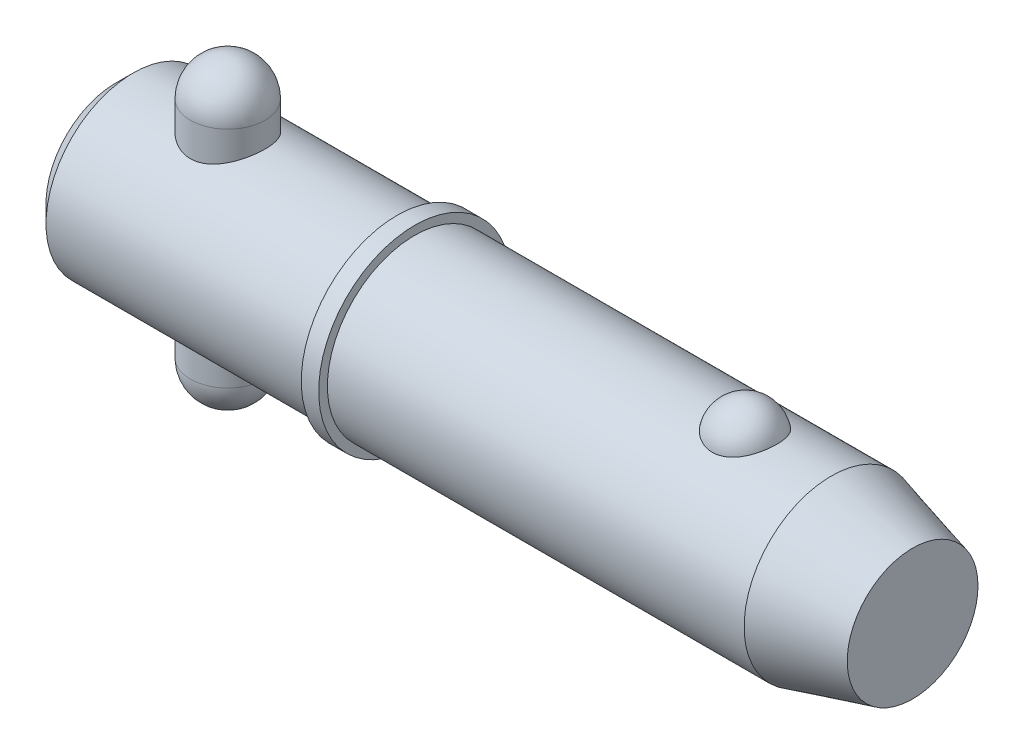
ISO-10303-21;
HEADER;
FILE_DESCRIPTION(('STEP AP214'),'2;1');
FILE_NAME('part.step','',(''),(''),'','','');
FILE_SCHEMA(('AUTOMOTIVE_DESIGN { 1 0 10303 214 1 1 1 1 }'));
ENDSEC;
DATA;
#1=APPLICATION_CONTEXT('core data for automotive mechanical design processes');
#2=APPLICATION_PROTOCOL_DEFINITION('international standard','automotive_design',2000,#1);
#3=PRODUCT_CONTEXT('',#1,'mechanical');
#4=PRODUCT('Part','Part','',(#3));
#5=PRODUCT_RELATED_PRODUCT_CATEGORY('part','',(#4));
#6=PRODUCT_DEFINITION_FORMATION('','',#4);
#7=PRODUCT_DEFINITION_CONTEXT('part definition',#1,'design');
#8=PRODUCT_DEFINITION('design','',#6,#7);
#9=PRODUCT_DEFINITION_SHAPE('','',#8);
#10=(LENGTH_UNIT() NAMED_UNIT(*) SI_UNIT(.MILLI.,.METRE.));
#11=(NAMED_UNIT(*) PLANE_ANGLE_UNIT() SI_UNIT($,.RADIAN.));
#12=(NAMED_UNIT(*) SI_UNIT($,.STERADIAN.) SOLID_ANGLE_UNIT());
#13=UNCERTAINTY_MEASURE_WITH_UNIT(LENGTH_MEASURE(1.E-05),#10,'distance_accuracy_value','');
#14=(GEOMETRIC_REPRESENTATION_CONTEXT(3) GLOBAL_UNCERTAINTY_ASSIGNED_CONTEXT((#13)) GLOBAL_UNIT_ASSIGNED_CONTEXT((#10,
#11,#12)) REPRESENTATION_CONTEXT('',''));
#15=CARTESIAN_POINT('',(0.,0.,0.));
#16=DIRECTION('',(0.,0.,1.));
#17=DIRECTION('',(1.,0.,0.));
#18=AXIS2_PLACEMENT_3D('',#15,#16,#17);
#19=CARTESIAN_POINT('',(14.28,19.05,0.));
#20=DIRECTION('',(0.,-1.,0.));
#21=DIRECTION('',(0.,0.,-1.));
#22=AXIS2_PLACEMENT_3D('',#19,#20,#21);
#23=CYLINDRICAL_SURFACE('',#22,4.76);
#24=CARTESIAN_POINT('',(14.28,-14.29,0.));
#25=DIRECTION('',(0.,-1.,0.));
#26=DIRECTION('',(0.,0.,-1.));
#27=AXIS2_PLACEMENT_3D('',#24,#25,#26);
#28=CIRCLE('',#27,4.76);
#29=CARTESIAN_POINT('',(14.28,-14.29,-4.76));
#30=VERTEX_POINT('',#29);
#31=EDGE_CURVE('P0_E10',#30,#30,#28,.F.);
#32=CARTESIAN_POINT('',(14.28,14.29,0.));
#33=DIRECTION('',(0.,-1.,0.));
#34=DIRECTION('',(0.,0.,-1.));
#35=AXIS2_PLACEMENT_3D('',#32,#33,#34);
#36=CIRCLE('',#35,4.76);
#37=CARTESIAN_POINT('',(14.28,14.29,-4.76));
#38=VERTEX_POINT('',#37);
#39=EDGE_CURVE('P0_E21',#38,#38,#36,.T.);
#40=CARTESIAN_POINT('',(14.28,-14.29,-4.76));
#41=CARTESIAN_POINT('',(14.28,-13.9922916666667,-4.76));
#42=CARTESIAN_POINT('',(14.28,-13.6945833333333,-4.76));
#43=CARTESIAN_POINT('',(14.28,-13.0991666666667,-4.76));
#44=CARTESIAN_POINT('',(14.28,-12.8014583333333,-4.76));
#45=CARTESIAN_POINT('',(14.28,-12.2060416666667,-4.76));
#46=CARTESIAN_POINT('',(14.28,-11.9083333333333,-4.76));
#47=CARTESIAN_POINT('',(14.28,-11.3129166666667,-4.76));
#48=CARTESIAN_POINT('',(14.28,-11.0152083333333,-4.76));
#49=CARTESIAN_POINT('',(14.28,-10.4197916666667,-4.76));
#50=CARTESIAN_POINT('',(14.28,-10.1220833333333,-4.76));
#51=CARTESIAN_POINT('',(14.28,-9.52666666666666,-4.76));
#52=CARTESIAN_POINT('',(14.28,-9.22895833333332,-4.76));
#53=CARTESIAN_POINT('',(14.28,-8.63354166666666,-4.76));
#54=CARTESIAN_POINT('',(14.28,-8.33583333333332,-4.76));
#55=CARTESIAN_POINT('',(14.28,-7.74041666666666,-4.76));
#56=CARTESIAN_POINT('',(14.28,-7.44270833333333,-4.76));
#57=CARTESIAN_POINT('',(14.28,-6.84729166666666,-4.76));
#58=CARTESIAN_POINT('',(14.28,-6.54958333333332,-4.76));
#59=CARTESIAN_POINT('',(14.28,-5.95416666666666,-4.76));
#60=CARTESIAN_POINT('',(14.28,-5.65645833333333,-4.76));
#61=CARTESIAN_POINT('',(14.28,-5.06104166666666,-4.76));
#62=CARTESIAN_POINT('',(14.28,-4.76333333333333,-4.76));
#63=CARTESIAN_POINT('',(14.28,-4.16791666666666,-4.76));
#64=CARTESIAN_POINT('',(14.28,-3.87020833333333,-4.76));
#65=CARTESIAN_POINT('',(14.28,-3.27479166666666,-4.76));
#66=CARTESIAN_POINT('',(14.28,-2.97708333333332,-4.76));
#67=CARTESIAN_POINT('',(14.28,-2.38166666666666,-4.76));
#68=CARTESIAN_POINT('',(14.28,-2.08395833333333,-4.76));
#69=CARTESIAN_POINT('',(14.28,-1.48854166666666,-4.76));
#70=CARTESIAN_POINT('',(14.28,-1.19083333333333,-4.76));
#71=CARTESIAN_POINT('',(14.28,-0.595416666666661,-4.76));
#72=CARTESIAN_POINT('',(14.28,-0.297708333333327,-4.76));
#73=CARTESIAN_POINT('',(14.28,0.297708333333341,-4.76));
#74=CARTESIAN_POINT('',(14.28,0.595416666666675,-4.76));
#75=CARTESIAN_POINT('',(14.28,1.19083333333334,-4.76));
#76=CARTESIAN_POINT('',(14.28,1.48854166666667,-4.76));
#77=CARTESIAN_POINT('',(14.28,2.08395833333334,-4.76));
#78=CARTESIAN_POINT('',(14.28,2.38166666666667,-4.76));
#79=CARTESIAN_POINT('',(14.28,2.97708333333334,-4.76));
#80=CARTESIAN_POINT('',(14.28,3.27479166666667,-4.76));
#81=CARTESIAN_POINT('',(14.28,3.87020833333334,-4.76));
#82=CARTESIAN_POINT('',(14.28,4.16791666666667,-4.76));
#83=CARTESIAN_POINT('',(14.28,4.76333333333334,-4.76));
#84=CARTESIAN_POINT('',(14.28,5.06104166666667,-4.76));
#85=CARTESIAN_POINT('',(14.28,5.65645833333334,-4.76));
#86=CARTESIAN_POINT('',(14.28,5.95416666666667,-4.76));
#87=CARTESIAN_POINT('',(14.28,6.54958333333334,-4.76));
#88=CARTESIAN_POINT('',(14.28,6.84729166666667,-4.76));
#89=CARTESIAN_POINT('',(14.28,7.44270833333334,-4.76));
#90=CARTESIAN_POINT('',(14.28,7.74041666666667,-4.76));
#91=CARTESIAN_POINT('',(14.28,8.33583333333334,-4.76));
#92=CARTESIAN_POINT('',(14.28,8.63354166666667,-4.76));
#93=CARTESIAN_POINT('',(14.28,9.22895833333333,-4.76));
#94=CARTESIAN_POINT('',(14.28,9.52666666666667,-4.76));
#95=CARTESIAN_POINT('',(14.28,10.1220833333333,-4.76));
#96=CARTESIAN_POINT('',(14.28,10.4197916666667,-4.76));
#97=CARTESIAN_POINT('',(14.28,11.0152083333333,-4.76));
#98=CARTESIAN_POINT('',(14.28,11.3129166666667,-4.76));
#99=CARTESIAN_POINT('',(14.28,11.9083333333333,-4.76));
#100=CARTESIAN_POINT('',(14.28,12.2060416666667,-4.76));
#101=CARTESIAN_POINT('',(14.28,12.8014583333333,-4.76));
#102=CARTESIAN_POINT('',(14.28,13.0991666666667,-4.76));
#103=CARTESIAN_POINT('',(14.28,13.6945833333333,-4.76));
#104=CARTESIAN_POINT('',(14.28,13.9922916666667,-4.76));
#105=CARTESIAN_POINT('',(14.28,14.29,-4.76));
#106=B_SPLINE_CURVE_WITH_KNOTS('',3,(#40,#41,#42,#43,#44,#45,#46,#47,#48,#49,#50,#51,#52,#53,
#54,#55,#56,#57,#58,#59,#60,#61,#62,#63,#64,#65,#66,#67,#68,#69,#70,#71,#72,#73,#74,#75,#76,#77,
#78,#79,#80,#81,#82,#83,#84,#85,#86,#87,#88,#89,#90,#91,#92,#93,#94,#95,#96,#97,#98,#99,#100,
#101,#102,#103,#104,#105),.UNSPECIFIED.,.F.,.F.,(4,2,2,2,2,2,2,2,2,2,2,2,2,2,2,2,2,2,2,2,2,2,2,
2,2,2,2,2,2,2,2,2,4),(0.,0.893125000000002,1.78625,2.67937499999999,3.5725,4.465625,5.35875,
6.25187499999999,7.145,8.038125,8.93125,9.82437499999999,10.7175,11.610625,12.50375,13.396875,
14.29,15.183125,16.07625,16.969375,17.8625,18.755625,19.64875,20.541875,21.435,22.328125,
23.22125,24.114375,25.0075,25.900625,26.79375,27.686875,28.58),.UNSPECIFIED.);
#107=EDGE_CURVE('P0_BSEAM14',#30,#38,#106,.T.);
#108=ORIENTED_EDGE('',*,*,#31,.T.);
#109=ORIENTED_EDGE('',*,*,#39,.T.);
#110=ORIENTED_EDGE('',*,*,#107,.T.);
#111=ORIENTED_EDGE('',*,*,#107,.F.);
#112=EDGE_LOOP('',(#108,#110,#109,#111));
#113=FACE_BOUND('',#112,.T.);
#114=ADVANCED_FACE('P0_F14',(#113),#23,.T.);
#115=CARTESIAN_POINT('',(14.28,-14.29,0.));
#116=DIRECTION('',(0.,0.,1.));
#117=DIRECTION('',(1.,0.,0.));
#118=AXIS2_PLACEMENT_3D('',#115,#116,#117);
#119=SPHERICAL_SURFACE('',#118,4.76);
#120=CARTESIAN_POINT('',(14.28,-14.29,0.));
#121=DIRECTION('',(0.,-1.,0.));
#122=DIRECTION('',(0.,0.,-1.));
#123=AXIS2_PLACEMENT_3D('',#120,#121,#122);
#124=SPHERICAL_SURFACE('',#123,4.76);
#125=ORIENTED_EDGE('',*,*,#31,.F.);
#126=EDGE_LOOP('',(#125));
#127=FACE_BOUND('',#126,.T.);
#128=ADVANCED_FACE('P0_F29',(#127),#124,.T.);
#129=CARTESIAN_POINT('',(14.28,14.29,0.));
#130=DIRECTION('',(0.,0.,1.));
#131=DIRECTION('',(1.,0.,0.));
#132=AXIS2_PLACEMENT_3D('',#129,#130,#131);
#133=SPHERICAL_SURFACE('',#132,4.76);
#134=CARTESIAN_POINT('',(14.28,14.29,0.));
#135=DIRECTION('',(0.,-1.,0.));
#136=DIRECTION('',(0.,0.,-1.));
#137=AXIS2_PLACEMENT_3D('',#134,#135,#136);
#138=SPHERICAL_SURFACE('',#137,4.76);
#139=ORIENTED_EDGE('',*,*,#39,.F.);
#140=EDGE_LOOP('',(#139));
#141=FACE_BOUND('',#140,.T.);
#142=ADVANCED_FACE('P0_F16',(#141),#138,.T.);
#143=CLOSED_SHELL('',(#114,#128,#142));
#144=MANIFOLD_SOLID_BREP('P0_B1',#143);
#145=CARTESIAN_POINT('',(0.,0.,0.));
#146=DIRECTION('',(1.,0.,0.));
#147=DIRECTION('',(0.,0.,-1.));
#148=AXIS2_PLACEMENT_3D('',#145,#146,#147);
#149=CYLINDRICAL_SURFACE('',#148,11.115);
#150=CARTESIAN_POINT('',(91.229563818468,0.,0.));
#151=DIRECTION('',(1.,0.,0.));
#152=DIRECTION('',(0.,0.,-1.));
#153=AXIS2_PLACEMENT_3D('',#150,#151,#152);
#154=CIRCLE('',#153,11.115);
#155=CARTESIAN_POINT('',(91.229563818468,0.,-11.115));
#156=VERTEX_POINT('',#155);
#157=EDGE_CURVE('P1_E81',#156,#156,#154,.T.);
#158=ORIENTED_EDGE('',*,*,#157,.F.);
#159=EDGE_LOOP('',(#158));
#160=FACE_BOUND('',#159,.T.);
#161=CARTESIAN_POINT('',(38.1,0.,0.));
#162=DIRECTION('',(1.,0.,0.));
#163=DIRECTION('',(0.,0.,-1.));
#164=AXIS2_PLACEMENT_3D('',#161,#162,#163);
#165=CIRCLE('',#164,11.115);
#166=CARTESIAN_POINT('',(38.1,0.,-11.115));
#167=VERTEX_POINT('',#166);
#168=EDGE_CURVE('P1_E85',#167,#167,#165,.T.);
#169=ORIENTED_EDGE('',*,*,#168,.T.);
#170=EDGE_LOOP('',(#169));
#171=FACE_BOUND('',#170,.T.);
#172=CARTESIAN_POINT('',(80.2310680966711,10.3028087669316,4.17077409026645));
#173=CARTESIAN_POINT('',(80.0147756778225,10.3028003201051,4.17078240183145));
#174=CARTESIAN_POINT('',(79.7985488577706,10.3098895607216,4.15340593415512));
#175=CARTESIAN_POINT('',(79.3725408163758,10.3373834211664,4.08449540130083));
#176=CARTESIAN_POINT('',(79.1627577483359,10.3577841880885,4.03297121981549));
#177=CARTESIAN_POINT('',(78.7557825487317,10.4095237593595,3.89746513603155));
#178=CARTESIAN_POINT('',(78.5585726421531,10.4408466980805,3.81353029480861));
#179=CARTESIAN_POINT('',(78.1813382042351,10.5110236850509,3.61560339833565));
#180=CARTESIAN_POINT('',(78.0013171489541,10.5498792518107,3.50160528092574));
#181=CARTESIAN_POINT('',(77.6576842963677,10.6322884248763,3.24292464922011));
#182=CARTESIAN_POINT('',(77.4946861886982,10.6759443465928,3.09746040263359));
#183=CARTESIAN_POINT('',(77.1945911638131,10.7625291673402,2.78171925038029));
#184=CARTESIAN_POINT('',(77.0574990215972,10.8054579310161,2.61143778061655));
#185=CARTESIAN_POINT('',(76.8064084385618,10.8881935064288,2.24226695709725));
#186=CARTESIAN_POINT('',(76.6937105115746,10.9277761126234,2.04244123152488));
#187=CARTESIAN_POINT('',(76.5017771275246,10.997484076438,1.62578254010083));
#188=CARTESIAN_POINT('',(76.422544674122,11.0276085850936,1.40894804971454));
#189=CARTESIAN_POINT('',(76.2983034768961,11.0756732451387,0.961250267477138));
#190=CARTESIAN_POINT('',(76.253760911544,11.0934470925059,0.730239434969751));
#191=CARTESIAN_POINT('',(76.2015695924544,11.1143331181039,0.263439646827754));
#192=CARTESIAN_POINT('',(76.1939200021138,11.1174456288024,0.0276507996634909));
#193=CARTESIAN_POINT('',(76.2156105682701,11.1087161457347,-0.440729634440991));
#194=CARTESIAN_POINT('',(76.2447624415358,11.0969502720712,-0.673331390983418));
#195=CARTESIAN_POINT('',(76.3391432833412,11.0597872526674,-1.12996621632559));
#196=CARTESIAN_POINT('',(76.4043729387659,11.0343898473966,-1.35399912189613));
#197=CARTESIAN_POINT('',(76.5696984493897,10.972515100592,-1.78750286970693));
#198=CARTESIAN_POINT('',(76.6698386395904,10.9360236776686,-1.99695478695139));
#199=CARTESIAN_POINT('',(76.9029408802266,10.8557595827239,-2.3952066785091));
#200=CARTESIAN_POINT('',(77.0359054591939,10.8119863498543,-2.5840050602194));
#201=CARTESIAN_POINT('',(77.332407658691,10.7216733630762,-2.93635726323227));
#202=CARTESIAN_POINT('',(77.4960565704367,10.675123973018,-3.09981510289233));
#203=CARTESIAN_POINT('',(77.8498601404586,10.5846571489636,-3.39592247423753));
#204=CARTESIAN_POINT('',(78.0400123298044,10.5407394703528,-3.52857487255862));
#205=CARTESIAN_POINT('',(78.4375014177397,10.4616690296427,-3.75646057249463));
#206=CARTESIAN_POINT('',(78.6443670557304,10.4263443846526,-3.85245432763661));
#207=CARTESIAN_POINT('',(79.0729541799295,10.3675574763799,-4.00798747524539));
#208=CARTESIAN_POINT('',(79.294670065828,10.3440907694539,-4.06754052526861));
#209=CARTESIAN_POINT('',(79.7346695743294,10.3128282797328,-4.14614314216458));
#210=CARTESIAN_POINT('',(79.9525654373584,10.3043040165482,-4.1670783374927));
#211=CARTESIAN_POINT('',(80.3889495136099,10.3016771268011,-4.17357158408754));
#212=CARTESIAN_POINT('',(80.6074376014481,10.3075716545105,-4.15913661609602));
#213=CARTESIAN_POINT('',(81.0317442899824,10.3326686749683,-4.09636961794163));
#214=CARTESIAN_POINT('',(81.2377458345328,10.3514555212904,-4.0490957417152));
#215=CARTESIAN_POINT('',(81.6385764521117,10.399818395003,-3.92320197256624));
#216=CARTESIAN_POINT('',(81.8334046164,10.4293952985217,-3.84457953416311));
#217=CARTESIAN_POINT('',(82.2111917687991,10.4969600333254,-3.65612410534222));
#218=CARTESIAN_POINT('',(82.3937974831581,10.5351178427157,-3.54564545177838));
#219=CARTESIAN_POINT('',(82.7382040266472,10.6154999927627,-3.29718036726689));
#220=CARTESIAN_POINT('',(82.900000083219,10.657725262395,-3.15918764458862));
#221=CARTESIAN_POINT('',(83.2069596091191,10.744212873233,-2.85163580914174));
#222=CARTESIAN_POINT('',(83.3508919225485,10.7884718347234,-2.68084605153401));
#223=CARTESIAN_POINT('',(83.6092371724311,10.872374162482,-2.31721864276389));
#224=CARTESIAN_POINT('',(83.7236448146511,10.9120167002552,-2.12437704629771));
#225=CARTESIAN_POINT('',(83.9238739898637,10.9838919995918,-1.71516999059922));
#226=CARTESIAN_POINT('',(84.0086617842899,11.0158465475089,-1.498248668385));
#227=CARTESIAN_POINT('',(84.1426838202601,11.0673523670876,-1.052285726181));
#228=CARTESIAN_POINT('',(84.1919174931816,11.086903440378,-0.823243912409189));
#229=CARTESIAN_POINT('',(84.2538915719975,11.1116323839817,-0.359087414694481));
#230=CARTESIAN_POINT('',(84.2665662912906,11.1167843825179,-0.123962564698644));
#231=CARTESIAN_POINT('',(84.254973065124,11.1121144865,0.345220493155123));
#232=CARTESIAN_POINT('',(84.2307056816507,11.1022928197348,0.579278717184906));
#233=CARTESIAN_POINT('',(84.1459073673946,11.0687504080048,1.03866534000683));
#234=CARTESIAN_POINT('',(84.0855299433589,11.0450885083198,1.26402641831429));
#235=CARTESIAN_POINT('',(83.9298532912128,10.9863185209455,1.70076772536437));
#236=CARTESIAN_POINT('',(83.834551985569,10.9512097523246,1.91214712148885));
#237=CARTESIAN_POINT('',(83.6103974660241,10.8729733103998,2.31608359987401));
#238=CARTESIAN_POINT('',(83.4813806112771,10.8298068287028,2.50854240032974));
#239=CARTESIAN_POINT('',(83.1927327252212,10.7401896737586,2.86808766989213));
#240=CARTESIAN_POINT('',(83.0331022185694,10.6937390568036,3.03517457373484));
#241=CARTESIAN_POINT('',(82.6875341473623,10.6029321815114,3.33857581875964));
#242=CARTESIAN_POINT('',(82.5017089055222,10.5585680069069,3.47501541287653));
#243=CARTESIAN_POINT('',(82.1078750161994,10.4769321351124,3.71390897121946));
#244=CARTESIAN_POINT('',(81.8998635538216,10.439661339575,3.81635861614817));
#245=CARTESIAN_POINT('',(81.4540666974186,10.3749407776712,3.98910631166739));
#246=CARTESIAN_POINT('',(81.2152342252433,10.3482457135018,4.05700929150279));
#247=CARTESIAN_POINT('',(80.7279254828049,10.312188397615,4.14782844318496));
#248=CARTESIAN_POINT('',(80.4794535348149,10.3028184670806,4.17076454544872));
#249=CARTESIAN_POINT('',(80.2310680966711,10.3028087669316,4.17077409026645));
#250=B_SPLINE_CURVE_WITH_KNOTS('',3,(#172,#173,#174,#175,#176,#177,#178,#179,#180,#181,#182,
#183,#184,#185,#186,#187,#188,#189,#190,#191,#192,#193,#194,#195,#196,#197,#198,#199,#200,#201,
#202,#203,#204,#205,#206,#207,#208,#209,#210,#211,#212,#213,#214,#215,#216,#217,#218,#219,#220,
#221,#222,#223,#224,#225,#226,#227,#228,#229,#230,#231,#232,#233,#234,#235,#236,#237,#238,#239,
#240,#241,#242,#243,#244,#245,#246,#247,#248,#249),.UNSPECIFIED.,.T.,.F.,(4,2,2,2,2,2,2,2,2,2,2,
2,2,2,2,2,2,2,2,2,2,2,2,2,2,2,2,2,2,2,2,2,2,2,2,2,2,2,4),(0.,0.647966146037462,1.29574482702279,
1.94258643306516,2.58955857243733,3.25496465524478,3.92049326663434,4.61566368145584,
5.31089647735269,6.01531821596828,6.71972398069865,7.42054043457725,8.12137023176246,
8.82309331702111,9.52487047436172,10.2292439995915,10.9335519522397,11.6223330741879,
12.3108558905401,12.9647664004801,13.6185478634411,14.2521847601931,14.8858731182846,
15.5334360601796,16.1811472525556,16.8611459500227,17.5412664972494,18.2431855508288,
18.9451158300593,19.6483065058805,20.3514864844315,21.0516982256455,21.7519516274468,
22.4556690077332,23.1593743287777,23.8601491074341,24.5610129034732,25.3054529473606,
26.049562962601),.UNSPECIFIED.);
#251=CARTESIAN_POINT('',(80.2310680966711,10.3028087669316,4.17077409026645));
#252=VERTEX_POINT('',#251);
#253=EDGE_CURVE('P1_E35',#252,#252,#250,.T.);
#254=ORIENTED_EDGE('',*,*,#253,.T.);
#255=EDGE_LOOP('',(#254));
#256=FACE_BOUND('',#255,.T.);
#257=ADVANCED_FACE('P1_F13',(#160,#171,#256),#149,.T.);
#258=CARTESIAN_POINT('',(0.,0.,0.));
#259=DIRECTION('',(-1.,0.,0.));
#260=DIRECTION('',(0.,0.,1.));
#261=AXIS2_PLACEMENT_3D('',#258,#259,#260);
#262=PLANE('',#261);
#263=CARTESIAN_POINT('',(0.,0.,0.));
#264=DIRECTION('',(1.,0.,0.));
#265=DIRECTION('',(0.,0.,-1.));
#266=AXIS2_PLACEMENT_3D('',#263,#264,#265);
#267=CIRCLE('',#266,8.892);
#268=CARTESIAN_POINT('',(0.,0.,-8.892));
#269=VERTEX_POINT('',#268);
#270=EDGE_CURVE('P1_E9',#269,#269,#267,.T.);
#271=ORIENTED_EDGE('',*,*,#270,.F.);
#272=EDGE_LOOP('',(#271));
#273=FACE_BOUND('',#272,.T.);
#274=ADVANCED_FACE('P1_F15',(#273),#262,.T.);
#275=CARTESIAN_POINT('',(2.22299999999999,0.,0.));
#276=DIRECTION('',(1.,0.,0.));
#277=DIRECTION('',(0.,0.,-1.));
#278=AXIS2_PLACEMENT_3D('',#275,#276,#277);
#279=CONICAL_SURFACE('',#278,11.115,0.78539816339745);
#280=ORIENTED_EDGE('',*,*,#270,.T.);
#281=EDGE_LOOP('',(#280));
#282=FACE_BOUND('',#281,.T.);
#283=CARTESIAN_POINT('',(2.22299999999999,0.,0.));
#284=DIRECTION('',(1.,0.,0.));
#285=DIRECTION('',(0.,0.,-1.));
#286=AXIS2_PLACEMENT_3D('',#283,#284,#285);
#287=CIRCLE('',#286,11.115);
#288=CARTESIAN_POINT('',(2.22299999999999,0.,-11.115));
#289=VERTEX_POINT('',#288);
#290=EDGE_CURVE('P1_E26',#289,#289,#287,.T.);
#291=ORIENTED_EDGE('',*,*,#290,.F.);
#292=EDGE_LOOP('',(#291));
#293=FACE_BOUND('',#292,.T.);
#294=ADVANCED_FACE('P1_F77',(#282,#293),#279,.T.);
#295=CARTESIAN_POINT('',(0.,0.,0.));
#296=DIRECTION('',(1.,0.,0.));
#297=DIRECTION('',(0.,0.,-1.));
#298=AXIS2_PLACEMENT_3D('',#295,#296,#297);
#299=CYLINDRICAL_SURFACE('',#298,11.115);
#300=CARTESIAN_POINT('',(14.28,-10.0441836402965,4.76));
#301=CARTESIAN_POINT('',(14.1533731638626,-10.0441846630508,4.75999904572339));
#302=CARTESIAN_POINT('',(14.0267055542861,-10.0465865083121,4.75493985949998));
#303=CARTESIAN_POINT('',(13.774298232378,-10.0561141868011,4.73475585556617));
#304=CARTESIAN_POINT('',(13.6485591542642,-10.0632429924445,4.71962470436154));
#305=CARTESIAN_POINT('',(13.3987500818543,-10.0819979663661,4.67942666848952));
#306=CARTESIAN_POINT('',(13.2746840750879,-10.0936334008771,4.65433930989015));
#307=CARTESIAN_POINT('',(13.0293244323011,-10.1210146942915,4.59449317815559));
#308=CARTESIAN_POINT('',(12.9080319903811,-10.1367622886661,4.55973032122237));
#309=CARTESIAN_POINT('',(12.669614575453,-10.1717810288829,4.48106435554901));
#310=CARTESIAN_POINT('',(12.5524727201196,-10.1910352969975,4.4372048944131));
#311=CARTESIAN_POINT('',(12.3224300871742,-10.2325403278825,4.34063417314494));
#312=CARTESIAN_POINT('',(12.2095309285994,-10.2547922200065,4.28791957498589));
#313=CARTESIAN_POINT('',(11.8782785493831,-10.3250879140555,4.11715127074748));
#314=CARTESIAN_POINT('',(11.6670799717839,-10.3767168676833,3.98637638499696));
#315=CARTESIAN_POINT('',(11.2564039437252,-10.4874309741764,3.68567149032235));
#316=CARTESIAN_POINT('',(11.0583793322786,-10.5467772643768,3.51386978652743));
#317=CARTESIAN_POINT('',(10.6927724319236,-10.6641377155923,3.13969960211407));
#318=CARTESIAN_POINT('',(10.5252022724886,-10.7221513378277,2.93731900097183));
#319=CARTESIAN_POINT('',(10.2965609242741,-10.8050020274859,2.60935726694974));
#320=CARTESIAN_POINT('',(10.2227768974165,-10.8324811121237,2.49310321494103));
#321=CARTESIAN_POINT('',(10.0853380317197,-10.884703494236,2.25418999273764));
#322=CARTESIAN_POINT('',(10.0216789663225,-10.9094479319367,2.13153352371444));
#323=CARTESIAN_POINT('',(9.90506238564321,-10.9554932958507,1.88060370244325));
#324=CARTESIAN_POINT('',(9.85210574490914,-10.9767939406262,1.7523298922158));
#325=CARTESIAN_POINT('',(9.75746464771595,-11.0153112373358,1.49115740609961));
#326=CARTESIAN_POINT('',(9.71577447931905,-11.0325299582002,1.35826111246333));
#327=CARTESIAN_POINT('',(9.64605475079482,-11.0615607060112,1.09614539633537));
#328=CARTESIAN_POINT('',(9.61740732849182,-11.0736151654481,0.96711700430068));
#329=CARTESIAN_POINT('',(9.57092026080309,-11.0932687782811,0.706847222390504));
#330=CARTESIAN_POINT('',(9.55307574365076,-11.1008699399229,0.575606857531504));
#331=CARTESIAN_POINT('',(9.52838640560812,-11.1114054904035,0.31192917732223));
#332=CARTESIAN_POINT('',(9.52153986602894,-11.114340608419,0.179492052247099));
#333=CARTESIAN_POINT('',(9.51892405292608,-11.1154607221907,-0.0855090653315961));
#334=CARTESIAN_POINT('',(9.52315432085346,-11.1136459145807,-0.218073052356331));
#335=CARTESIAN_POINT('',(9.542009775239,-11.1055891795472,-0.473709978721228));
#336=CARTESIAN_POINT('',(9.55594693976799,-11.099640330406,-0.596843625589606));
#337=CARTESIAN_POINT('',(9.59332832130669,-11.0837823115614,-0.841440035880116));
#338=CARTESIAN_POINT('',(9.61677567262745,-11.0738718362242,-0.962902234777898));
#339=CARTESIAN_POINT('',(9.67294089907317,-11.0503378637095,-1.20325684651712));
#340=CARTESIAN_POINT('',(9.70565569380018,-11.0367156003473,-1.32215009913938));
#341=CARTESIAN_POINT('',(9.78005008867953,-11.0060908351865,-1.55666640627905));
#342=CARTESIAN_POINT('',(9.82173311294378,-10.9890870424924,-1.67228819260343));
#343=CARTESIAN_POINT('',(9.96110379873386,-10.9330280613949,-2.01656166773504));
#344=CARTESIAN_POINT('',(10.0722987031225,-10.8892801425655,-2.23915547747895));
#345=CARTESIAN_POINT('',(10.3268588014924,-10.7934745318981,-2.66299199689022));
#346=CARTESIAN_POINT('',(10.4702355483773,-10.7414138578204,-2.86422700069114));
#347=CARTESIAN_POINT('',(10.7973904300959,-10.6296201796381,-3.25557775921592));
#348=CARTESIAN_POINT('',(10.9833705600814,-10.569604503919,-3.443774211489));
#349=CARTESIAN_POINT('',(11.3844486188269,-10.4514707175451,-3.78722133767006));
#350=CARTESIAN_POINT('',(11.5995590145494,-10.3933534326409,-3.94245783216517));
#351=CARTESIAN_POINT('',(11.9444340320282,-10.311516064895,-4.14990014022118));
#352=CARTESIAN_POINT('',(12.0654579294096,-10.2847012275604,-4.21573894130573));
#353=CARTESIAN_POINT('',(12.3132718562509,-10.2342051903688,-4.33688518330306));
#354=CARTESIAN_POINT('',(12.4400593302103,-10.2105226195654,-4.39219723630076));
#355=CARTESIAN_POINT('',(12.6985418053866,-10.1671237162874,-4.49174500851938));
#356=CARTESIAN_POINT('',(12.8302359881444,-10.1474067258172,-4.53598256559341));
#357=CARTESIAN_POINT('',(13.0975061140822,-10.1126841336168,-4.61287629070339));
#358=CARTESIAN_POINT('',(13.233079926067,-10.0976759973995,-4.64553869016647));
#359=CARTESIAN_POINT('',(13.4978553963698,-10.0737863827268,-4.6971059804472));
#360=CARTESIAN_POINT('',(13.6268754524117,-10.0645618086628,-4.716785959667));
#361=CARTESIAN_POINT('',(13.8862990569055,-10.051062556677,-4.74548419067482));
#362=CARTESIAN_POINT('',(14.0167019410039,-10.0467856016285,-4.75450734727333));
#363=CARTESIAN_POINT('',(14.277859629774,-10.0433352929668,-4.76179143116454));
#364=CARTESIAN_POINT('',(14.4086143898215,-10.0441613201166,-4.76005366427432));
#365=CARTESIAN_POINT('',(14.6694025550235,-10.0508838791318,-4.74584231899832));
#366=CARTESIAN_POINT('',(14.7994359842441,-10.0567802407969,-4.73336910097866));
#367=CARTESIAN_POINT('',(15.0487369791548,-10.0728449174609,-4.69907984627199));
#368=CARTESIAN_POINT('',(15.1681238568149,-10.0826872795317,-4.67797462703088));
#369=CARTESIAN_POINT('',(15.4045894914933,-10.1062580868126,-4.62682977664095));
#370=CARTESIAN_POINT('',(15.5216674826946,-10.1199877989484,-4.59678723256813));
#371=CARTESIAN_POINT('',(15.868278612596,-10.1664161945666,-4.49365911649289));
#372=CARTESIAN_POINT('',(16.0933756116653,-10.2043671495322,-4.40754694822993));
#373=CARTESIAN_POINT('',(16.5357981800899,-10.2919879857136,-4.19898201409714));
#374=CARTESIAN_POINT('',(16.7523611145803,-10.3420954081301,-4.07511281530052));
#375=CARTESIAN_POINT('',(17.1627188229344,-10.4477911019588,-3.7959429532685));
#376=CARTESIAN_POINT('',(17.3565033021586,-10.5033818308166,-3.64062816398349));
#377=CARTESIAN_POINT('',(17.7334034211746,-10.6196376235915,-3.28693729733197));
#378=CARTESIAN_POINT('',(17.9141276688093,-10.6803237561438,-3.08599175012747));
#379=CARTESIAN_POINT('',(18.1582189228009,-10.7666348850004,-2.76320365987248));
#380=CARTESIAN_POINT('',(18.2351223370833,-10.7946346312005,-2.65197124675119));
#381=CARTESIAN_POINT('',(18.3793967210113,-10.8483267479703,-2.42297927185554));
#382=CARTESIAN_POINT('',(18.4467718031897,-10.87402011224,-2.30522255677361));
#383=CARTESIAN_POINT('',(18.5717669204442,-10.9225249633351,-2.06324665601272));
#384=CARTESIAN_POINT('',(18.6293326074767,-10.9453202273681,-1.93899615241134));
#385=CARTESIAN_POINT('',(18.73370006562,-10.9872100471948,-1.6855059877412));
#386=CARTESIAN_POINT('',(18.7805065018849,-11.0063062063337,-1.55626851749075));
#387=CARTESIAN_POINT('',(18.8628731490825,-11.0402419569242,-1.29375150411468));
#388=CARTESIAN_POINT('',(18.8984366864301,-11.0550828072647,-1.16047316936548));
#389=CARTESIAN_POINT('',(18.9579183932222,-11.0800638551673,-0.890912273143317));
#390=CARTESIAN_POINT('',(18.9818374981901,-11.0902044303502,-0.75462995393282));
#391=CARTESIAN_POINT('',(19.0164177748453,-11.104911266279,-0.490295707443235));
#392=CARTESIAN_POINT('',(19.027922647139,-11.1098318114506,-0.362373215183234));
#393=CARTESIAN_POINT('',(19.040554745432,-11.1152360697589,-0.105876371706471));
#394=CARTESIAN_POINT('',(19.0416784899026,-11.1157182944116,0.0226981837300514));
#395=CARTESIAN_POINT('',(19.0335275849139,-11.1122291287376,0.27938352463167));
#396=CARTESIAN_POINT('',(19.0242587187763,-11.1082602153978,0.407494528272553));
#397=CARTESIAN_POINT('',(18.9954320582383,-11.0959792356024,0.662388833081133));
#398=CARTESIAN_POINT('',(18.9758704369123,-11.0876655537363,0.789171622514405));
#399=CARTESIAN_POINT('',(18.9276379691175,-11.0673259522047,1.03545890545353));
#400=CARTESIAN_POINT('',(18.8993573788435,-11.0554596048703,1.15505309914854));
#401=CARTESIAN_POINT('',(18.8337694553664,-11.0282166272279,1.39134516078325));
#402=CARTESIAN_POINT('',(18.7964589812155,-11.0128387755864,1.5080420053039));
#403=CARTESIAN_POINT('',(18.671464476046,-10.9619666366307,1.85262797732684));
#404=CARTESIAN_POINT('',(18.5706772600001,-10.9217161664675,2.07521484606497));
#405=CARTESIAN_POINT('',(18.33202463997,-10.8301378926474,2.51061719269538));
#406=CARTESIAN_POINT('',(18.1926775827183,-10.7783885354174,2.72252375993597));
#407=CARTESIAN_POINT('',(17.8829747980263,-10.669863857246,3.12088015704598));
#408=CARTESIAN_POINT('',(17.7126068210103,-10.6130865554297,3.30731987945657));
#409=CARTESIAN_POINT('',(17.3310036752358,-10.495668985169,3.66358491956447));
#410=CARTESIAN_POINT('',(17.1177010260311,-10.4350471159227,3.83122543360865));
#411=CARTESIAN_POINT('',(16.7778915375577,-10.3495418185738,4.05420569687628));
#412=CARTESIAN_POINT('',(16.6612023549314,-10.3219229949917,4.12383380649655));
#413=CARTESIAN_POINT('',(16.4218466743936,-10.2693487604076,4.25306463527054));
#414=CARTESIAN_POINT('',(16.2991829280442,-10.2443921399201,4.31267191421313));
#415=CARTESIAN_POINT('',(16.0488008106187,-10.1979981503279,4.42126071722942));
#416=CARTESIAN_POINT('',(15.9210894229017,-10.1765561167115,4.47025635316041));
#417=CARTESIAN_POINT('',(15.6613937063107,-10.1379191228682,4.55720152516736));
#418=CARTESIAN_POINT('',(15.5294115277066,-10.1207220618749,4.59515652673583));
#419=CARTESIAN_POINT('',(15.2624981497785,-10.091252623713,4.65951684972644));
#420=CARTESIAN_POINT('',(15.1275757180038,-10.0789672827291,4.68595259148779));
#421=CARTESIAN_POINT('',(14.8556442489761,-10.0597530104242,4.72706206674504));
#422=CARTESIAN_POINT('',(14.7186368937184,-10.0528199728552,4.74174481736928));
#423=CARTESIAN_POINT('',(14.5310955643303,-10.047196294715,4.75363843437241));
#424=CARTESIAN_POINT('',(14.48091543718,-10.0460674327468,4.75602323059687));
#425=CARTESIAN_POINT('',(14.3804923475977,-10.044560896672,4.7592042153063));
#426=CARTESIAN_POINT('',(14.3302493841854,-10.0441832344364,4.76000037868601));
#427=CARTESIAN_POINT('',(14.28,-10.0441836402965,4.76));
#428=B_SPLINE_CURVE_WITH_KNOTS('',3,(#300,#301,#302,#303,#304,#305,#306,#307,#308,#309,#310,
#311,#312,#313,#314,#315,#316,#317,#318,#319,#320,#321,#322,#323,#324,#325,#326,#327,#328,#329,
#330,#331,#332,#333,#334,#335,#336,#337,#338,#339,#340,#341,#342,#343,#344,#345,#346,#347,#348,
#349,#350,#351,#352,#353,#354,#355,#356,#357,#358,#359,#360,#361,#362,#363,#364,#365,#366,#367,
#368,#369,#370,#371,#372,#373,#374,#375,#376,#377,#378,#379,#380,#381,#382,#383,#384,#385,#386,
#387,#388,#389,#390,#391,#392,#393,#394,#395,#396,#397,#398,#399,#400,#401,#402,#403,#404,#405,
#406,#407,#408,#409,#410,#411,#412,#413,#414,#415,#416,#417,#418,#419,#420,#421,#422,#423,#424,
#425,#426,#427),.UNSPECIFIED.,.T.,.F.,(4,2,2,2,2,2,2,2,2,2,2,2,2,2,2,2,2,2,2,2,2,2,2,2,2,2,2,2,
2,2,2,2,2,2,2,2,2,2,2,2,2,2,2,2,2,2,2,2,2,2,2,2,2,2,2,2,2,2,2,2,2,2,2,4),(0.,0.379828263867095,
0.759895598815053,1.14074858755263,1.52176256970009,1.90098898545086,2.28035867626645,
3.03818035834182,3.84125131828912,4.6446414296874,5.06541657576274,5.48601561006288,
5.90664899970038,6.3270687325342,6.72470503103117,7.12216187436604,7.51955659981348,
7.91693487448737,8.28868404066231,8.66055582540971,9.03230414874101,9.40419465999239,
10.1585834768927,10.9132435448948,11.7236471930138,12.5343987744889,12.9550196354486,
13.3754557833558,13.7958221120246,14.2159617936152,14.6079540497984,14.9997658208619,
15.3915300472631,15.7832811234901,16.1477615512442,16.512360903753,17.240999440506,
18.0012974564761,18.761937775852,19.5886929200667,20.0025782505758,20.4162843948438,
20.832212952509,21.2479608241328,21.6635855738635,22.0791769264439,22.4642880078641,
22.8495282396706,23.2345541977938,23.6197234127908,23.9896813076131,24.3597680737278,
25.099327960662,25.8726239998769,26.6462260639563,27.4759193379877,27.8914891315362,
28.3068693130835,28.7216936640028,29.1363123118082,29.5498292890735,29.9630287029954,
30.113753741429,30.2644811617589),.UNSPECIFIED.);
#429=CARTESIAN_POINT('',(14.28,-10.0441836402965,4.76));
#430=VERTEX_POINT('',#429);
#431=EDGE_CURVE('P1_E17',#430,#430,#428,.T.);
#432=ORIENTED_EDGE('',*,*,#431,.F.);
#433=EDGE_LOOP('',(#432));
#434=FACE_BOUND('',#433,.T.);
#435=CARTESIAN_POINT('',(14.28,10.0441836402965,4.76));
#436=CARTESIAN_POINT('',(14.4066268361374,10.0441846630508,4.75999904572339));
#437=CARTESIAN_POINT('',(14.5332944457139,10.0465865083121,4.75493985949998));
#438=CARTESIAN_POINT('',(14.785701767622,10.0561141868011,4.73475585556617));
#439=CARTESIAN_POINT('',(14.9114408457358,10.0632429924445,4.71962470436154));
#440=CARTESIAN_POINT('',(15.1612499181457,10.0819979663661,4.67942666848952));
#441=CARTESIAN_POINT('',(15.2853159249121,10.0936334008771,4.65433930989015));
#442=CARTESIAN_POINT('',(15.5306755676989,10.1210146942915,4.59449317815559));
#443=CARTESIAN_POINT('',(15.6519680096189,10.1367622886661,4.55973032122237));
#444=CARTESIAN_POINT('',(15.890385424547,10.1717810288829,4.48106435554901));
#445=CARTESIAN_POINT('',(16.0075272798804,10.1910352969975,4.4372048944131));
#446=CARTESIAN_POINT('',(16.2375699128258,10.2325403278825,4.34063417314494));
#447=CARTESIAN_POINT('',(16.3504690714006,10.2547922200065,4.28791957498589));
#448=CARTESIAN_POINT('',(16.6817214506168,10.3250879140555,4.11715127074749));
#449=CARTESIAN_POINT('',(16.8929200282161,10.3767168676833,3.98637638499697));
#450=CARTESIAN_POINT('',(17.3035960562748,10.4874309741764,3.68567149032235));
#451=CARTESIAN_POINT('',(17.5016206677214,10.5467772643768,3.51386978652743));
#452=CARTESIAN_POINT('',(17.8672275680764,10.6641377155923,3.13969960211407));
#453=CARTESIAN_POINT('',(18.0347977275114,10.7221513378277,2.93731900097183));
#454=CARTESIAN_POINT('',(18.2634390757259,10.8050020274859,2.60935726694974));
#455=CARTESIAN_POINT('',(18.3372231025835,10.8324811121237,2.49310321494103));
#456=CARTESIAN_POINT('',(18.4746619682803,10.884703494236,2.25418999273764));
#457=CARTESIAN_POINT('',(18.5383210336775,10.9094479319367,2.13153352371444));
#458=CARTESIAN_POINT('',(18.6549376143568,10.9554932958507,1.88060370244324));
#459=CARTESIAN_POINT('',(18.7078942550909,10.9767939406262,1.75232989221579));
#460=CARTESIAN_POINT('',(18.8025353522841,11.0153112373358,1.4911574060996));
#461=CARTESIAN_POINT('',(18.844225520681,11.0325299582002,1.35826111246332));
#462=CARTESIAN_POINT('',(18.9139452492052,11.0615607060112,1.09614539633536));
#463=CARTESIAN_POINT('',(18.9425926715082,11.0736151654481,0.967117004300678));
#464=CARTESIAN_POINT('',(18.9890797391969,11.0932687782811,0.706847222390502));
#465=CARTESIAN_POINT('',(19.0069242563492,11.1008699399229,0.575606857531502));
#466=CARTESIAN_POINT('',(19.0316135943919,11.1114054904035,0.311929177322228));
#467=CARTESIAN_POINT('',(19.0384601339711,11.114340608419,0.179492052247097));
#468=CARTESIAN_POINT('',(19.0410759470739,11.1154607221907,-0.0855090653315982));
#469=CARTESIAN_POINT('',(19.0368456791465,11.1136459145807,-0.218073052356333));
#470=CARTESIAN_POINT('',(19.017990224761,11.1055891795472,-0.47370997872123));
#471=CARTESIAN_POINT('',(19.004053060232,11.099640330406,-0.596843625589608));
#472=CARTESIAN_POINT('',(18.9666716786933,11.0837823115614,-0.841440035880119));
#473=CARTESIAN_POINT('',(18.9432243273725,11.0738718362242,-0.9629022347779));
#474=CARTESIAN_POINT('',(18.8870591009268,11.0503378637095,-1.20325684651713));
#475=CARTESIAN_POINT('',(18.8543443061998,11.0367156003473,-1.32215009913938));
#476=CARTESIAN_POINT('',(18.7799499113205,11.0060908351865,-1.55666640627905));
#477=CARTESIAN_POINT('',(18.7382668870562,10.9890870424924,-1.67228819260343));
#478=CARTESIAN_POINT('',(18.5988962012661,10.9330280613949,-2.01656166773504));
#479=CARTESIAN_POINT('',(18.4877012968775,10.8892801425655,-2.23915547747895));
#480=CARTESIAN_POINT('',(18.2331411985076,10.7934745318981,-2.66299199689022));
#481=CARTESIAN_POINT('',(18.0897644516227,10.7414138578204,-2.86422700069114));
#482=CARTESIAN_POINT('',(17.7626095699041,10.6296201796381,-3.25557775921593));
#483=CARTESIAN_POINT('',(17.5766294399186,10.569604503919,-3.443774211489));
#484=CARTESIAN_POINT('',(17.1755513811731,10.4514707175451,-3.78722133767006));
#485=CARTESIAN_POINT('',(16.9604409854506,10.3933534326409,-3.94245783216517));
#486=CARTESIAN_POINT('',(16.6155659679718,10.311516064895,-4.14990014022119));
#487=CARTESIAN_POINT('',(16.4945420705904,10.2847012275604,-4.21573894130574));
#488=CARTESIAN_POINT('',(16.2467281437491,10.2342051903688,-4.33688518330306));
#489=CARTESIAN_POINT('',(16.1199406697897,10.2105226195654,-4.39219723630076));
#490=CARTESIAN_POINT('',(15.8614581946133,10.1671237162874,-4.49174500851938));
#491=CARTESIAN_POINT('',(15.7297640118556,10.1474067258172,-4.53598256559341));
#492=CARTESIAN_POINT('',(15.4624938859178,10.1126841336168,-4.61287629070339));
#493=CARTESIAN_POINT('',(15.326920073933,10.0976759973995,-4.64553869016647));
#494=CARTESIAN_POINT('',(15.0621446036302,10.0737863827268,-4.6971059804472));
#495=CARTESIAN_POINT('',(14.9331245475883,10.0645618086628,-4.716785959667));
#496=CARTESIAN_POINT('',(14.6737009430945,10.051062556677,-4.74548419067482));
#497=CARTESIAN_POINT('',(14.543298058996,10.0467856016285,-4.75450734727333));
#498=CARTESIAN_POINT('',(14.2821403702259,10.0433352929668,-4.76179143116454));
#499=CARTESIAN_POINT('',(14.1513856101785,10.0441613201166,-4.76005366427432));
#500=CARTESIAN_POINT('',(13.8905974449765,10.0508838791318,-4.74584231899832));
#501=CARTESIAN_POINT('',(13.7605640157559,10.0567802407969,-4.73336910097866));
#502=CARTESIAN_POINT('',(13.5112630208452,10.0728449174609,-4.69907984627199));
#503=CARTESIAN_POINT('',(13.3918761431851,10.0826872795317,-4.67797462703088));
#504=CARTESIAN_POINT('',(13.1554105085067,10.1062580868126,-4.62682977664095));
#505=CARTESIAN_POINT('',(13.0383325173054,10.1199877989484,-4.59678723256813));
#506=CARTESIAN_POINT('',(12.691721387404,10.1664161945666,-4.49365911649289));
#507=CARTESIAN_POINT('',(12.4666243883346,10.2043671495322,-4.40754694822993));
#508=CARTESIAN_POINT('',(12.0242018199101,10.2919879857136,-4.19898201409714));
#509=CARTESIAN_POINT('',(11.8076388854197,10.3420954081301,-4.07511281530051));
#510=CARTESIAN_POINT('',(11.3972811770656,10.4477911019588,-3.7959429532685));
#511=CARTESIAN_POINT('',(11.2034966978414,10.5033818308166,-3.64062816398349));
#512=CARTESIAN_POINT('',(10.8265965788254,10.6196376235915,-3.28693729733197));
#513=CARTESIAN_POINT('',(10.6458723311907,10.6803237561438,-3.08599175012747));
#514=CARTESIAN_POINT('',(10.4017810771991,10.7666348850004,-2.76320365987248));
#515=CARTESIAN_POINT('',(10.3248776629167,10.7946346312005,-2.65197124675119));
#516=CARTESIAN_POINT('',(10.1806032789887,10.8483267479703,-2.42297927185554));
#517=CARTESIAN_POINT('',(10.1132281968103,10.87402011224,-2.30522255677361));
#518=CARTESIAN_POINT('',(9.98823307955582,10.9225249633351,-2.06324665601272));
#519=CARTESIAN_POINT('',(9.93066739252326,10.9453202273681,-1.93899615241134));
#520=CARTESIAN_POINT('',(9.82629993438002,10.9872100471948,-1.6855059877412));
#521=CARTESIAN_POINT('',(9.77949349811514,11.0063062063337,-1.55626851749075));
#522=CARTESIAN_POINT('',(9.69712685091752,11.0402419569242,-1.29375150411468));
#523=CARTESIAN_POINT('',(9.66156331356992,11.0550828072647,-1.16047316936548));
#524=CARTESIAN_POINT('',(9.60208160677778,11.0800638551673,-0.890912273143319));
#525=CARTESIAN_POINT('',(9.57816250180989,11.0902044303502,-0.754629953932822));
#526=CARTESIAN_POINT('',(9.54358222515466,11.104911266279,-0.490295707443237));
#527=CARTESIAN_POINT('',(9.53207735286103,11.1098318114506,-0.362373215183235));
#528=CARTESIAN_POINT('',(9.51944525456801,11.1152360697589,-0.105876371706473));
#529=CARTESIAN_POINT('',(9.51832151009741,11.1157182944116,0.0226981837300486));
#530=CARTESIAN_POINT('',(9.52647241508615,11.1122291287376,0.279383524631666));
#531=CARTESIAN_POINT('',(9.53574128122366,11.1082602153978,0.407494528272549));
#532=CARTESIAN_POINT('',(9.5645679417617,11.0959792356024,0.662388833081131));
#533=CARTESIAN_POINT('',(9.58412956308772,11.0876655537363,0.789171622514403));
#534=CARTESIAN_POINT('',(9.63236203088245,11.0673259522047,1.03545890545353));
#535=CARTESIAN_POINT('',(9.66064262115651,11.0554596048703,1.15505309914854));
#536=CARTESIAN_POINT('',(9.72623054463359,11.0282166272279,1.39134516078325));
#537=CARTESIAN_POINT('',(9.76354101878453,11.0128387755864,1.5080420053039));
#538=CARTESIAN_POINT('',(9.88853552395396,10.9619666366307,1.85262797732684));
#539=CARTESIAN_POINT('',(9.98932273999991,10.9217161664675,2.07521484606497));
#540=CARTESIAN_POINT('',(10.22797536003,10.8301378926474,2.51061719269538));
#541=CARTESIAN_POINT('',(10.3673224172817,10.7783885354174,2.72252375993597));
#542=CARTESIAN_POINT('',(10.6770252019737,10.669863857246,3.12088015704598));
#543=CARTESIAN_POINT('',(10.8473931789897,10.6130865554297,3.30731987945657));
#544=CARTESIAN_POINT('',(11.2289963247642,10.495668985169,3.66358491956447));
#545=CARTESIAN_POINT('',(11.4422989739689,10.4350471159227,3.83122543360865));
#546=CARTESIAN_POINT('',(11.7821084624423,10.3495418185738,4.05420569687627));
#547=CARTESIAN_POINT('',(11.8987976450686,10.3219229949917,4.12383380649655));
#548=CARTESIAN_POINT('',(12.1381533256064,10.2693487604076,4.25306463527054));
#549=CARTESIAN_POINT('',(12.2608170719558,10.2443921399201,4.31267191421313));
#550=CARTESIAN_POINT('',(12.5111991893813,10.1979981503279,4.42126071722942));
#551=CARTESIAN_POINT('',(12.6389105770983,10.1765561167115,4.47025635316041));
#552=CARTESIAN_POINT('',(12.8986062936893,10.1379191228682,4.55720152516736));
#553=CARTESIAN_POINT('',(13.0305884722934,10.1207220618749,4.59515652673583));
#554=CARTESIAN_POINT('',(13.2975018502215,10.091252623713,4.65951684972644));
#555=CARTESIAN_POINT('',(13.4324242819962,10.0789672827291,4.68595259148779));
#556=CARTESIAN_POINT('',(13.7043557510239,10.0597530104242,4.72706206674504));
#557=CARTESIAN_POINT('',(13.8413631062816,10.0528199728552,4.74174481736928));
#558=CARTESIAN_POINT('',(14.0289044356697,10.047196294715,4.75363843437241));
#559=CARTESIAN_POINT('',(14.07908456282,10.0460674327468,4.75602323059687));
#560=CARTESIAN_POINT('',(14.1795076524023,10.044560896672,4.7592042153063));
#561=CARTESIAN_POINT('',(14.2297506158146,10.0441832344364,4.76000037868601));
#562=CARTESIAN_POINT('',(14.28,10.0441836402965,4.76));
#563=B_SPLINE_CURVE_WITH_KNOTS('',3,(#435,#436,#437,#438,#439,#440,#441,#442,#443,#444,#445,
#446,#447,#448,#449,#450,#451,#452,#453,#454,#455,#456,#457,#458,#459,#460,#461,#462,#463,#464,
#465,#466,#467,#468,#469,#470,#471,#472,#473,#474,#475,#476,#477,#478,#479,#480,#481,#482,#483,
#484,#485,#486,#487,#488,#489,#490,#491,#492,#493,#494,#495,#496,#497,#498,#499,#500,#501,#502,
#503,#504,#505,#506,#507,#508,#509,#510,#511,#512,#513,#514,#515,#516,#517,#518,#519,#520,#521,
#522,#523,#524,#525,#526,#527,#528,#529,#530,#531,#532,#533,#534,#535,#536,#537,#538,#539,#540,
#541,#542,#543,#544,#545,#546,#547,#548,#549,#550,#551,#552,#553,#554,#555,#556,#557,#558,#559,
#560,#561,#562),.UNSPECIFIED.,.T.,.F.,(4,2,2,2,2,2,2,2,2,2,2,2,2,2,2,2,2,2,2,2,2,2,2,2,2,2,2,2,
2,2,2,2,2,2,2,2,2,2,2,2,2,2,2,2,2,2,2,2,2,2,2,2,2,2,2,2,2,2,2,2,2,2,2,4),(0.,0.379828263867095,
0.759895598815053,1.14074858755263,1.52176256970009,1.90098898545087,2.28035867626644,
3.03818035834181,3.84125131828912,4.6446414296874,5.06541657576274,5.48601561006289,
5.90664899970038,6.3270687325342,6.72470503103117,7.12216187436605,7.51955659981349,
7.91693487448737,8.28868404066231,8.66055582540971,9.03230414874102,9.4041946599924,
10.1585834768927,10.9132435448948,11.7236471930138,12.5343987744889,12.9550196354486,
13.3754557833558,13.7958221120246,14.2159617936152,14.6079540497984,14.9997658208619,
15.3915300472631,15.7832811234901,16.1477615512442,16.512360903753,17.240999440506,
18.0012974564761,18.761937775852,19.5886929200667,20.0025782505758,20.4162843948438,
20.832212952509,21.2479608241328,21.6635855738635,22.0791769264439,22.4642880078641,
22.8495282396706,23.2345541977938,23.6197234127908,23.9896813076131,24.3597680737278,
25.099327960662,25.8726239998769,26.6462260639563,27.4759193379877,27.8914891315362,
28.3068693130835,28.7216936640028,29.1363123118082,29.5498292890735,29.9630287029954,
30.113753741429,30.2644811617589),.UNSPECIFIED.);
#564=CARTESIAN_POINT('',(14.28,10.0441836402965,4.76));
#565=VERTEX_POINT('',#564);
#566=EDGE_CURVE('P1_E43',#565,#565,#563,.T.);
#567=ORIENTED_EDGE('',*,*,#566,.F.);
#568=EDGE_LOOP('',(#567));
#569=FACE_BOUND('',#568,.T.);
#570=ORIENTED_EDGE('',*,*,#290,.T.);
#571=EDGE_LOOP('',(#570));
#572=FACE_BOUND('',#571,.T.);
#573=CARTESIAN_POINT('',(35.877,0.,0.));
#574=DIRECTION('',(1.,0.,0.));
#575=DIRECTION('',(0.,0.,-1.));
#576=AXIS2_PLACEMENT_3D('',#573,#574,#575);
#577=CIRCLE('',#576,11.115);
#578=CARTESIAN_POINT('',(35.877,0.,-11.115));
#579=VERTEX_POINT('',#578);
#580=EDGE_CURVE('P1_E31',#579,#579,#577,.T.);
#581=ORIENTED_EDGE('',*,*,#580,.F.);
#582=EDGE_LOOP('',(#581));
#583=FACE_BOUND('',#582,.T.);
#584=ADVANCED_FACE('P1_F103',(#434,#569,#572,#583),#299,.T.);
#585=CARTESIAN_POINT('',(35.877,11.115,0.));
#586=DIRECTION('',(-1.,0.,0.));
#587=DIRECTION('',(0.,0.,1.));
#588=AXIS2_PLACEMENT_3D('',#585,#586,#587);
#589=PLANE('',#588);
#590=ORIENTED_EDGE('',*,*,#580,.T.);
#591=EDGE_LOOP('',(#590));
#592=FACE_BOUND('',#591,.T.);
#593=CARTESIAN_POINT('',(35.877,0.,0.));
#594=DIRECTION('',(1.,0.,0.));
#595=DIRECTION('',(0.,0.,-1.));
#596=AXIS2_PLACEMENT_3D('',#593,#594,#595);
#597=CIRCLE('',#596,12.2265);
#598=CARTESIAN_POINT('',(35.877,0.,-12.2265));
#599=VERTEX_POINT('',#598);
#600=EDGE_CURVE('P1_E91',#599,#599,#597,.T.);
#601=ORIENTED_EDGE('',*,*,#600,.F.);
#602=EDGE_LOOP('',(#601));
#603=FACE_BOUND('',#602,.T.);
#604=ADVANCED_FACE('P1_F100',(#592,#603),#589,.T.);
#605=CARTESIAN_POINT('',(0.,0.,0.));
#606=DIRECTION('',(1.,0.,0.));
#607=DIRECTION('',(0.,0.,-1.));
#608=AXIS2_PLACEMENT_3D('',#605,#606,#607);
#609=CYLINDRICAL_SURFACE('',#608,12.2265);
#610=ORIENTED_EDGE('',*,*,#600,.T.);
#611=EDGE_LOOP('',(#610));
#612=FACE_BOUND('',#611,.T.);
#613=CARTESIAN_POINT('',(38.1,0.,0.));
#614=DIRECTION('',(1.,0.,0.));
#615=DIRECTION('',(0.,0.,-1.));
#616=AXIS2_PLACEMENT_3D('',#613,#614,#615);
#617=CIRCLE('',#616,12.2265);
#618=CARTESIAN_POINT('',(38.1,0.,-12.2265));
#619=VERTEX_POINT('',#618);
#620=EDGE_CURVE('P1_E88',#619,#619,#617,.T.);
#621=ORIENTED_EDGE('',*,*,#620,.F.);
#622=EDGE_LOOP('',(#621));
#623=FACE_BOUND('',#622,.T.);
#624=ADVANCED_FACE('P1_F68',(#612,#623),#609,.T.);
#625=CARTESIAN_POINT('',(38.1,12.2265,0.));
#626=DIRECTION('',(1.,0.,0.));
#627=DIRECTION('',(0.,0.,-1.));
#628=AXIS2_PLACEMENT_3D('',#625,#626,#627);
#629=PLANE('',#628);
#630=ORIENTED_EDGE('',*,*,#620,.T.);
#631=EDGE_LOOP('',(#630));
#632=FACE_BOUND('',#631,.T.);
#633=ORIENTED_EDGE('',*,*,#168,.F.);
#634=EDGE_LOOP('',(#633));
#635=FACE_BOUND('',#634,.T.);
#636=ADVANCED_FACE('P1_F62',(#632,#635),#629,.T.);
#637=CARTESIAN_POINT('',(101.6,0.,0.));
#638=DIRECTION('',(-1.,0.,0.));
#639=DIRECTION('',(0.,0.,1.));
#640=AXIS2_PLACEMENT_3D('',#637,#638,#639);
#641=CONICAL_SURFACE('',#640,8.33625000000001,0.26179938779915);
#642=ORIENTED_EDGE('',*,*,#157,.T.);
#643=EDGE_LOOP('',(#642));
#644=FACE_BOUND('',#643,.T.);
#645=CARTESIAN_POINT('',(101.6,0.,0.));
#646=DIRECTION('',(1.,0.,0.));
#647=DIRECTION('',(0.,0.,-1.));
#648=AXIS2_PLACEMENT_3D('',#645,#646,#647);
#649=CIRCLE('',#648,8.33625000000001);
#650=CARTESIAN_POINT('',(101.6,0.,-8.33625000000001));
#651=VERTEX_POINT('',#650);
#652=EDGE_CURVE('P1_E42',#651,#651,#649,.T.);
#653=ORIENTED_EDGE('',*,*,#652,.F.);
#654=EDGE_LOOP('',(#653));
#655=FACE_BOUND('',#654,.T.);
#656=ADVANCED_FACE('P1_F59',(#644,#655),#641,.T.);
#657=CARTESIAN_POINT('',(101.6,8.33625000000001,0.));
#658=DIRECTION('',(1.,0.,0.));
#659=DIRECTION('',(0.,0.,-1.));
#660=AXIS2_PLACEMENT_3D('',#657,#658,#659);
#661=PLANE('',#660);
#662=ORIENTED_EDGE('',*,*,#652,.T.);
#663=EDGE_LOOP('',(#662));
#664=FACE_BOUND('',#663,.T.);
#665=ADVANCED_FACE('P1_F55',(#664),#661,.T.);
#666=CARTESIAN_POINT('',(80.2310680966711,10.0035,0.));
#667=DIRECTION('',(-1.,0.,0.));
#668=DIRECTION('',(0.,1.,0.));
#669=AXIS2_PLACEMENT_3D('',#666,#667,#668);
#670=SPHERICAL_SURFACE('',#669,4.18150000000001);
#671=ORIENTED_EDGE('',*,*,#253,.F.);
#672=EDGE_LOOP('',(#671));
#673=FACE_BOUND('',#672,.T.);
#674=ADVANCED_FACE('P1_F50',(#673),#670,.T.);
#675=CARTESIAN_POINT('',(14.28,-12.2265,0.));
#676=DIRECTION('',(0.,1.,0.));
#677=DIRECTION('',(0.,0.,1.));
#678=AXIS2_PLACEMENT_3D('',#675,#676,#677);
#679=CYLINDRICAL_SURFACE('',#678,4.76);
#680=ORIENTED_EDGE('',*,*,#431,.T.);
#681=EDGE_LOOP('',(#680));
#682=FACE_BOUND('',#681,.T.);
#683=ORIENTED_EDGE('',*,*,#566,.T.);
#684=EDGE_LOOP('',(#683));
#685=FACE_BOUND('',#684,.T.);
#686=ADVANCED_FACE('P1_F54',(#682,#685),#679,.F.);
#687=CLOSED_SHELL('',(#257,#274,#294,#584,#604,#624,#636,#656,#665,#674,#686));
#688=MANIFOLD_SOLID_BREP('P1_B1',#687);
#689=ADVANCED_BREP_SHAPE_REPRESENTATION('',(#18,#144,#688),#14);
#690=SHAPE_DEFINITION_REPRESENTATION(#9,#689);
ENDSEC;
END-ISO-10303-21;
